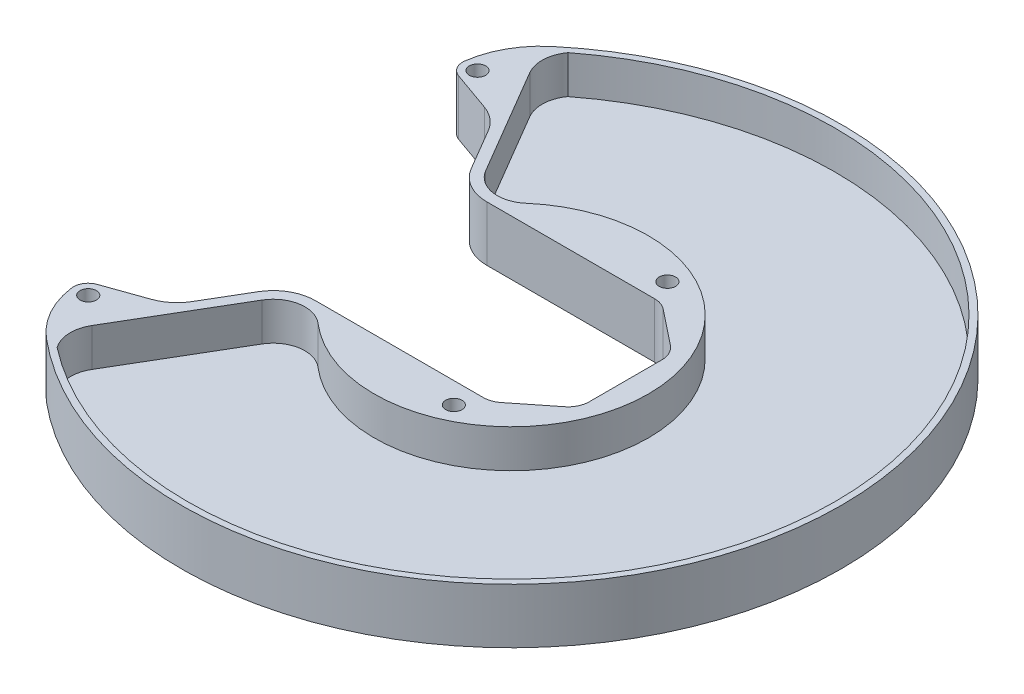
from build123d import *

# Parameters (mm, degrees)
BOSS_EXTRUDE1_DEPTH          = 16.51
BOSS_EXTRUDE2_DEPTH          = 5.08
FILLET1_R                    = 6.35
BOSS_EXTRUDE3_DEPTH          = 16.51
F_10_0_1935_DIAMETER_HOLE1_D = 4.9149


with BuildPart() as part:
    # Sketch1 → Boss-Extrude1 (new body)
    with BuildSketch(Plane(origin=(0, 0, 0), x_dir=(1, 0, 0), z_dir=(0, 1, 0))):
        with BuildLine():
            Line((34.29, -13.97), (34.29, 13.97))
            Line((34.29, 13.97), (19.516909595, 25.702371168))
            Line((19.516909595, 25.702371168), (-33.071442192, 25.702371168))
            ThreePointArc((-33.071442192, 25.702371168), (-39.377537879, 27.378616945), (-44.018977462, 31.9648661))
            Line((-44.018977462, 31.9648661), (-67.730120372, 72.287719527))
            ThreePointArc((-67.730120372, 72.287719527), (99.06, 0), (-67.730120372, -72.287719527))
            Line((-67.730120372, -72.287719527), (-44.018977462, -31.9648661))
            ThreePointArc((-44.018977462, -31.9648661), (-39.377537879, -27.378616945), (-33.071442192, -25.702371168))
            Line((-33.071442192, -25.702371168), (19.516909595, -25.702371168))
            Line((19.516909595, -25.702371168), (34.29, -13.97))
        make_face()
        with BuildLine():
            Line((-60.190030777, 65.728828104), (-41.282093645, 33.574242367))
            ThreePointArc((-41.282093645, 33.574242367), (-34.627830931, 29.005388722), (-26.855864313, 31.184877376))
            ThreePointArc((-26.855864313, 31.184877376), (41.155, 0), (-26.855864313, -31.184877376))
            ThreePointArc((-26.855864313, -31.184877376), (-34.627830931, -29.005388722), (-41.282093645, -33.574242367))
            Line((-41.282093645, -33.574242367), (-60.190030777, -65.728828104))
            ThreePointArc((-60.190030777, -65.728828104), (-61.560449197, -71.275789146), (-59.673723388, -76.669033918))
            ThreePointArc((-59.673723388, -76.669033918), (97.155, 0), (-59.673723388, 76.669033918))
            ThreePointArc((-59.673723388, 76.669033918), (-61.560449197, 71.275789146), (-60.190030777, 65.728828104))
        make_face(mode=Mode.SUBTRACT)
    extrude(amount=BOSS_EXTRUDE1_DEPTH)

    # Sketch4 → Boss-Extrude2 (add)
    with BuildSketch(Plane.XZ):
        with BuildLine():
            Line((19.516909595, -25.702371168), (-33.071442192, -25.702371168))
            ThreePointArc((-33.071442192, -25.702371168), (-39.377537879, -27.378616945), (-44.018977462, -31.9648661))
            Line((-44.018977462, -31.9648661), (-67.730120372, -72.287719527))
            ThreePointArc((-67.730120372, -72.287719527), (99.06, 0), (-67.730120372, 72.287719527))
            Line((-67.730120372, 72.287719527), (-44.018977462, 31.9648661))
            ThreePointArc((-44.018977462, 31.9648661), (-39.377537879, 27.378616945), (-33.071442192, 25.702371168))
            Line((-33.071442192, 25.702371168), (19.516909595, 25.702371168))
            Line((19.516909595, 25.702371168), (34.29, 13.97))
            Line((34.29, 13.97), (34.29, -13.97))
            Line((34.29, -13.97), (19.516909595, -25.702371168))
        make_face()
    extrude(amount=-BOSS_EXTRUDE2_DEPTH)

    # Fillet1
    fillet1_edges = [part.edges().sort_by_distance(p)[0] for p in [
        (34.29, 8.255, 13.97),
        (34.29, 8.255, -13.97),
        (19.516909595, 8.255, -25.702371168),
        (-67.730120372, 8.255, -72.287719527),
        (-67.730120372, 8.255, 72.287719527),
        (19.516909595, 8.255, 25.702371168),
    ]]
    fillet(fillet1_edges, radius=FILLET1_R)

    # Sketch5 → Boss-Extrude3 (add)
    with BuildSketch(Plane(origin=(0, 16.51, 0), x_dir=(1, 0, 0), z_dir=(0, 1, 0))):
        with BuildLine():
            Line((-70.063238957, 54.229770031), (-58.07034997, 49.984580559))
            ThreePointArc((-58.07034997, 49.984580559), (-54.226919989, 47.809602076), (-51.360640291, 44.45))
            Line((-51.360640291, 44.45), (-65.083554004, 67.787004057))
            ThreePointArc((-65.083554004, 67.787004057), (-65.867791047, 72.08273266), (-63.692648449, 75.869164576))
            ThreePointArc((-63.692648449, 75.869164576), (-69.90821256, 68.310554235), (-72.984241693, 59.020566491))
            ThreePointArc((-72.984241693, 59.020566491), (-72.375199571, 56.106023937), (-70.063238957, 54.229770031))
        make_face()
    boss_extrude3 = extrude(amount=-BOSS_EXTRUDE3_DEPTH)

    # Mirror1: Boss-Extrude3 across plane
    add(boss_extrude3.mirror(Plane.XY))

    # 10 _0.1935_ Diameter Hole1 (through all)
    with Locations(Plane(origin=(0, 16.51, 0), x_dir=(1, 0, 0), z_dir=(0, 1, 0))):
        with Locations((-68.58, 58.42), (-68.58, -58.42), (14.798375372, -32.052371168), (14.798375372, 32.052371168)):
            Hole(F_10_0_1935_DIAMETER_HOLE1_D / 2)


solid = part.part
